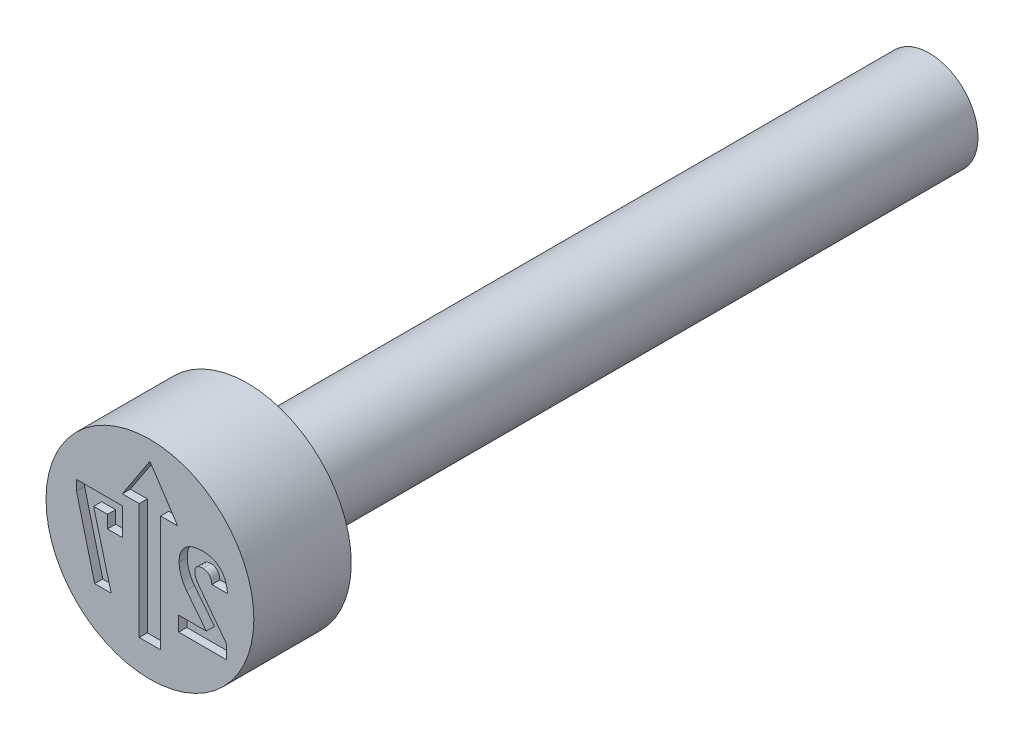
ISO-10303-21;
HEADER;
FILE_DESCRIPTION(('STEP AP214'),'2;1');
FILE_NAME('part.step','',(''),(''),'','','');
FILE_SCHEMA(('AUTOMOTIVE_DESIGN { 1 0 10303 214 1 1 1 1 }'));
ENDSEC;
DATA;
#1=APPLICATION_CONTEXT('core data for automotive mechanical design processes');
#2=APPLICATION_PROTOCOL_DEFINITION('international standard','automotive_design',2000,#1);
#3=PRODUCT_CONTEXT('',#1,'mechanical');
#4=PRODUCT('Part','Part','',(#3));
#5=PRODUCT_RELATED_PRODUCT_CATEGORY('part','',(#4));
#6=PRODUCT_DEFINITION_FORMATION('','',#4);
#7=PRODUCT_DEFINITION_CONTEXT('part definition',#1,'design');
#8=PRODUCT_DEFINITION('design','',#6,#7);
#9=PRODUCT_DEFINITION_SHAPE('','',#8);
#10=(LENGTH_UNIT() NAMED_UNIT(*) SI_UNIT(.MILLI.,.METRE.));
#11=(NAMED_UNIT(*) PLANE_ANGLE_UNIT() SI_UNIT($,.RADIAN.));
#12=(NAMED_UNIT(*) SI_UNIT($,.STERADIAN.) SOLID_ANGLE_UNIT());
#13=UNCERTAINTY_MEASURE_WITH_UNIT(LENGTH_MEASURE(1.E-05),#10,'distance_accuracy_value','');
#14=(GEOMETRIC_REPRESENTATION_CONTEXT(3) GLOBAL_UNCERTAINTY_ASSIGNED_CONTEXT((#13)) GLOBAL_UNIT_ASSIGNED_CONTEXT((#10,
#11,#12)) REPRESENTATION_CONTEXT('',''));
#15=CARTESIAN_POINT('',(0.,0.,0.));
#16=DIRECTION('',(0.,0.,1.));
#17=DIRECTION('',(1.,0.,0.));
#18=AXIS2_PLACEMENT_3D('',#15,#16,#17);
#19=CARTESIAN_POINT('',(-0.33,-2.25,-4.2002794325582));
#20=DIRECTION('',(-1.,0.,0.));
#21=DIRECTION('',(0.,0.,1.));
#22=AXIS2_PLACEMENT_3D('',#19,#20,#21);
#23=PLANE('',#22);
#24=DIRECTION('',(0.,-1.,0.));
#25=VECTOR('',#24,1.);
#26=CARTESIAN_POINT('',(-0.33,1.32083870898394,-0.24895886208));
#27=LINE('',#26,#25);
#28=CARTESIAN_POINT('',(-0.33,1.32083870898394,-0.24895886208));
#29=VERTEX_POINT('',#28);
#30=CARTESIAN_POINT('',(-0.33,-2.25,-0.24895886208));
#31=VERTEX_POINT('',#30);
#32=EDGE_CURVE('E51',#29,#31,#27,.T.);
#33=ORIENTED_EDGE('',*,*,#32,.F.);
#34=DIRECTION('',(0.,0.,1.));
#35=VECTOR('',#34,1.);
#36=CARTESIAN_POINT('',(-0.33,1.32083870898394,-0.28447943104));
#37=LINE('',#36,#35);
#38=CARTESIAN_POINT('',(-0.33,1.32083870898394,0.));
#39=VERTEX_POINT('',#38);
#40=EDGE_CURVE('E434',#39,#29,#37,.F.);
#41=ORIENTED_EDGE('',*,*,#40,.F.);
#42=DIRECTION('',(0.,1.,0.));
#43=VECTOR('',#42,1.);
#44=CARTESIAN_POINT('',(-0.33,0.,0.));
#45=LINE('',#44,#43);
#46=CARTESIAN_POINT('',(-0.33,-2.25,0.));
#47=VERTEX_POINT('',#46);
#48=EDGE_CURVE('E468',#47,#39,#45,.T.);
#49=ORIENTED_EDGE('',*,*,#48,.F.);
#50=DIRECTION('',(0.,0.,-1.));
#51=VECTOR('',#50,1.);
#52=CARTESIAN_POINT('',(-0.33,-2.25,-4.2002794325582));
#53=LINE('',#52,#51);
#54=EDGE_CURVE('E262',#47,#31,#53,.T.);
#55=ORIENTED_EDGE('',*,*,#54,.T.);
#56=EDGE_LOOP('',(#33,#41,#49,#55));
#57=FACE_BOUND('',#56,.T.);
#58=ADVANCED_FACE('F37',(#57),#23,.F.);
#59=CARTESIAN_POINT('',(5.684330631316E-13,1.32083870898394,-0.28447943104));
#60=DIRECTION('',(0.,1.,0.));
#61=DIRECTION('',(0.,0.,1.));
#62=AXIS2_PLACEMENT_3D('',#59,#60,#61);
#63=PLANE('',#62);
#64=ORIENTED_EDGE('',*,*,#40,.T.);
#65=DIRECTION('',(1.,0.,0.));
#66=VECTOR('',#65,1.);
#67=CARTESIAN_POINT('',(-0.851282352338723,1.32083870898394,-0.24895886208));
#68=LINE('',#67,#66);
#69=CARTESIAN_POINT('',(-0.851282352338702,1.32083870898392,-0.24895886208));
#70=VERTEX_POINT('',#69);
#71=EDGE_CURVE('E58',#70,#29,#68,.T.);
#72=ORIENTED_EDGE('',*,*,#71,.F.);
#73=DIRECTION('',(0.,0.,1.));
#74=VECTOR('',#73,1.);
#75=CARTESIAN_POINT('',(-0.851282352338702,1.32083870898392,-1.30047739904));
#76=LINE('',#75,#74);
#77=CARTESIAN_POINT('',(-0.851282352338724,1.32083870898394,0.));
#78=VERTEX_POINT('',#77);
#79=EDGE_CURVE('E438',#70,#78,#76,.T.);
#80=ORIENTED_EDGE('',*,*,#79,.T.);
#81=DIRECTION('',(1.,0.,0.));
#82=VECTOR('',#81,1.);
#83=CARTESIAN_POINT('',(1.59999680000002,1.32083870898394,0.));
#84=LINE('',#83,#82);
#85=EDGE_CURVE('E436',#39,#78,#84,.F.);
#86=ORIENTED_EDGE('',*,*,#85,.F.);
#87=EDGE_LOOP('',(#64,#72,#80,#86));
#88=FACE_BOUND('',#87,.T.);
#89=ADVANCED_FACE('F427',(#88),#63,.T.);
#90=CARTESIAN_POINT('',(-1.44383534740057,0.421431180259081,-1.30047739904));
#91=DIRECTION('',(-0.835059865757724,0.550159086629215,0.));
#92=DIRECTION('',(-0.550159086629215,-0.835059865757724,0.));
#93=AXIS2_PLACEMENT_3D('',#90,#91,#92);
#94=PLANE('',#93);
#95=DIRECTION('',(-0.550159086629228,-0.835059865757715,0.));
#96=VECTOR('',#95,1.);
#97=CARTESIAN_POINT('',(0.,2.61295901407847,-0.24895886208));
#98=LINE('',#97,#96);
#99=CARTESIAN_POINT('',(0.,2.61295901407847,-0.24895886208));
#100=VERTEX_POINT('',#99);
#101=EDGE_CURVE('E443',#100,#70,#98,.T.);
#102=ORIENTED_EDGE('',*,*,#101,.F.);
#103=DIRECTION('',(0.,0.,1.));
#104=VECTOR('',#103,1.);
#105=CARTESIAN_POINT('',(0.,2.61295901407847,-1.30047739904));
#106=LINE('',#105,#104);
#107=CARTESIAN_POINT('',(0.,2.61295901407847,0.));
#108=VERTEX_POINT('',#107);
#109=EDGE_CURVE('E456',#100,#108,#106,.T.);
#110=ORIENTED_EDGE('',*,*,#109,.T.);
#111=DIRECTION('',(0.550159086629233,0.835059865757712,0.));
#112=VECTOR('',#111,1.);
#113=CARTESIAN_POINT('',(-0.851282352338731,1.32083870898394,0.));
#114=LINE('',#113,#112);
#115=EDGE_CURVE('E463',#78,#108,#114,.T.);
#116=ORIENTED_EDGE('',*,*,#115,.F.);
#117=ORIENTED_EDGE('',*,*,#79,.F.);
#118=EDGE_LOOP('',(#102,#110,#116,#117));
#119=FACE_BOUND('',#118,.T.);
#120=ADVANCED_FACE('F424',(#119),#94,.F.);
#121=CARTESIAN_POINT('',(0.,2.61295901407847,-1.30047739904));
#122=DIRECTION('',(0.835059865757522,0.550159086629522,0.));
#123=DIRECTION('',(-0.550159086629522,0.835059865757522,0.));
#124=AXIS2_PLACEMENT_3D('',#121,#122,#123);
#125=PLANE('',#124);
#126=DIRECTION('',(-0.550159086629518,0.835059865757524,0.));
#127=VECTOR('',#126,1.);
#128=CARTESIAN_POINT('',(0.851282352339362,1.32083870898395,-0.24895886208));
#129=LINE('',#128,#127);
#130=CARTESIAN_POINT('',(0.851282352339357,1.32083870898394,-0.24895886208));
#131=VERTEX_POINT('',#130);
#132=EDGE_CURVE('E444',#131,#100,#129,.T.);
#133=ORIENTED_EDGE('',*,*,#132,.F.);
#134=DIRECTION('',(0.,0.,1.));
#135=VECTOR('',#134,1.);
#136=CARTESIAN_POINT('',(0.851282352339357,1.32083870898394,-0.28447943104));
#137=LINE('',#136,#135);
#138=CARTESIAN_POINT('',(0.851282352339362,1.32083870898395,0.));
#139=VERTEX_POINT('',#138);
#140=EDGE_CURVE('E451',#139,#131,#137,.F.);
#141=ORIENTED_EDGE('',*,*,#140,.F.);
#142=DIRECTION('',(0.550159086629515,-0.835059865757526,0.));
#143=VECTOR('',#142,1.);
#144=CARTESIAN_POINT('',(0.,2.61295901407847,0.));
#145=LINE('',#144,#143);
#146=EDGE_CURVE('E466',#108,#139,#145,.T.);
#147=ORIENTED_EDGE('',*,*,#146,.F.);
#148=ORIENTED_EDGE('',*,*,#109,.F.);
#149=EDGE_LOOP('',(#133,#141,#147,#148));
#150=FACE_BOUND('',#149,.T.);
#151=ADVANCED_FACE('F420',(#150),#125,.F.);
#152=CARTESIAN_POINT('',(5.684330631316E-13,1.32083870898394,-0.28447943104));
#153=DIRECTION('',(0.,1.,0.));
#154=DIRECTION('',(0.,0.,1.));
#155=AXIS2_PLACEMENT_3D('',#152,#153,#154);
#156=PLANE('',#155);
#157=ORIENTED_EDGE('',*,*,#140,.T.);
#158=DIRECTION('',(1.,0.,0.));
#159=VECTOR('',#158,1.);
#160=CARTESIAN_POINT('',(0.33,1.32083870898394,-0.24895886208));
#161=LINE('',#160,#159);
#162=CARTESIAN_POINT('',(0.33,1.32083870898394,-0.24895886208));
#163=VERTEX_POINT('',#162);
#164=EDGE_CURVE('E448',#163,#131,#161,.T.);
#165=ORIENTED_EDGE('',*,*,#164,.F.);
#166=DIRECTION('',(0.,0.,-1.));
#167=VECTOR('',#166,1.);
#168=CARTESIAN_POINT('',(0.33,1.32083870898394,-4.2002794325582));
#169=LINE('',#168,#167);
#170=CARTESIAN_POINT('',(0.33,1.32083870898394,0.));
#171=VERTEX_POINT('',#170);
#172=EDGE_CURVE('E263',#163,#171,#169,.F.);
#173=ORIENTED_EDGE('',*,*,#172,.T.);
#174=DIRECTION('',(1.,0.,0.));
#175=VECTOR('',#174,1.);
#176=CARTESIAN_POINT('',(1.59999680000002,1.32083870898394,0.));
#177=LINE('',#176,#175);
#178=EDGE_CURVE('E453',#139,#171,#177,.F.);
#179=ORIENTED_EDGE('',*,*,#178,.F.);
#180=EDGE_LOOP('',(#157,#165,#173,#179));
#181=FACE_BOUND('',#180,.T.);
#182=ADVANCED_FACE('F417',(#181),#156,.T.);
#183=CARTESIAN_POINT('',(0.33,-2.25,-4.2002794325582));
#184=DIRECTION('',(1.,0.,0.));
#185=DIRECTION('',(0.,0.,-1.));
#186=AXIS2_PLACEMENT_3D('',#183,#184,#185);
#187=PLANE('',#186);
#188=DIRECTION('',(0.,1.,0.));
#189=VECTOR('',#188,1.);
#190=CARTESIAN_POINT('',(0.33,-2.25,-0.24895886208));
#191=LINE('',#190,#189);
#192=CARTESIAN_POINT('',(0.33,-2.25,-0.24895886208));
#193=VERTEX_POINT('',#192);
#194=EDGE_CURVE('E267',#193,#163,#191,.T.);
#195=ORIENTED_EDGE('',*,*,#194,.F.);
#196=DIRECTION('',(0.,0.,-1.));
#197=VECTOR('',#196,1.);
#198=CARTESIAN_POINT('',(0.33,-2.25,-4.2002794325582));
#199=LINE('',#198,#197);
#200=CARTESIAN_POINT('',(0.33,-2.25,0.));
#201=VERTEX_POINT('',#200);
#202=EDGE_CURVE('E251',#193,#201,#199,.F.);
#203=ORIENTED_EDGE('',*,*,#202,.T.);
#204=DIRECTION('',(0.,1.,0.));
#205=VECTOR('',#204,1.);
#206=CARTESIAN_POINT('',(0.33,0.,0.));
#207=LINE('',#206,#205);
#208=EDGE_CURVE('E473',#171,#201,#207,.F.);
#209=ORIENTED_EDGE('',*,*,#208,.F.);
#210=ORIENTED_EDGE('',*,*,#172,.F.);
#211=EDGE_LOOP('',(#195,#203,#209,#210));
#212=FACE_BOUND('',#211,.T.);
#213=ADVANCED_FACE('F268',(#212),#187,.F.);
#214=CARTESIAN_POINT('',(-0.33,-2.25,-4.2002794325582));
#215=DIRECTION('',(0.,-1.,0.));
#216=DIRECTION('',(0.,0.,-1.));
#217=AXIS2_PLACEMENT_3D('',#214,#215,#216);
#218=PLANE('',#217);
#219=DIRECTION('',(1.,0.,0.));
#220=VECTOR('',#219,1.);
#221=CARTESIAN_POINT('',(-0.33,-2.25,-0.24895886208));
#222=LINE('',#221,#220);
#223=EDGE_CURVE('E256',#31,#193,#222,.T.);
#224=ORIENTED_EDGE('',*,*,#223,.F.);
#225=ORIENTED_EDGE('',*,*,#54,.F.);
#226=DIRECTION('',(1.,0.,0.));
#227=VECTOR('',#226,1.);
#228=CARTESIAN_POINT('',(1.59999680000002,-2.25,0.));
#229=LINE('',#228,#227);
#230=EDGE_CURVE('E258',#201,#47,#229,.F.);
#231=ORIENTED_EDGE('',*,*,#230,.F.);
#232=ORIENTED_EDGE('',*,*,#202,.F.);
#233=EDGE_LOOP('',(#224,#225,#231,#232));
#234=FACE_BOUND('',#233,.T.);
#235=ADVANCED_FACE('F253',(#234),#218,.F.);
#236=CARTESIAN_POINT('',(1.59999680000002,0.,0.));
#237=DIRECTION('',(0.,0.,1.));
#238=DIRECTION('',(1.,0.,0.));
#239=AXIS2_PLACEMENT_3D('',#236,#237,#238);
#240=PLANE('',#239);
#241=DIRECTION('',(-1.,0.,0.));
#242=VECTOR('',#241,1.);
#243=CARTESIAN_POINT('',(-0.83687877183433,1.,0.));
#244=LINE('',#243,#242);
#245=CARTESIAN_POINT('',(-0.83687877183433,1.,0.));
#246=VERTEX_POINT('',#245);
#247=CARTESIAN_POINT('',(-2.2593625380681,1.,0.));
#248=VERTEX_POINT('',#247);
#249=EDGE_CURVE('E271',#246,#248,#244,.T.);
#250=ORIENTED_EDGE('',*,*,#249,.F.);
#251=DIRECTION('',(0.,1.,0.));
#252=VECTOR('',#251,1.);
#253=CARTESIAN_POINT('',(-0.83687877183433,0.155844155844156,0.));
#254=LINE('',#253,#252);
#255=CARTESIAN_POINT('',(-0.83687877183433,0.155844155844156,0.));
#256=VERTEX_POINT('',#255);
#257=EDGE_CURVE('E282',#256,#246,#254,.T.);
#258=ORIENTED_EDGE('',*,*,#257,.F.);
#259=DIRECTION('',(1.,0.,0.));
#260=VECTOR('',#259,1.);
#261=CARTESIAN_POINT('',(-1.30613607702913,0.155844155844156,0.));
#262=LINE('',#261,#260);
#263=CARTESIAN_POINT('',(-1.30613607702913,0.155844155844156,0.));
#264=VERTEX_POINT('',#263);
#265=EDGE_CURVE('E326',#264,#256,#262,.T.);
#266=ORIENTED_EDGE('',*,*,#265,.F.);
#267=DIRECTION('',(0.,-1.,0.));
#268=VECTOR('',#267,1.);
#269=CARTESIAN_POINT('',(-1.30613607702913,0.545454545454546,0.));
#270=LINE('',#269,#268);
#271=CARTESIAN_POINT('',(-1.30613607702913,0.545454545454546,0.));
#272=VERTEX_POINT('',#271);
#273=EDGE_CURVE('E323',#272,#264,#270,.T.);
#274=ORIENTED_EDGE('',*,*,#273,.F.);
#275=DIRECTION('',(1.,0.,0.));
#276=VECTOR('',#275,1.);
#277=CARTESIAN_POINT('',(-1.73379435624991,0.545454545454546,0.));
#278=LINE('',#277,#276);
#279=CARTESIAN_POINT('',(-1.73379435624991,0.545454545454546,0.));
#280=VERTEX_POINT('',#279);
#281=EDGE_CURVE('E320',#280,#272,#278,.T.);
#282=ORIENTED_EDGE('',*,*,#281,.F.);
#283=DIRECTION('',(-0.255602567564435,0.966781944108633,0.));
#284=VECTOR('',#283,1.);
#285=CARTESIAN_POINT('',(-1.19300701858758,-1.5,0.));
#286=LINE('',#285,#284);
#287=CARTESIAN_POINT('',(-1.19300701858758,-1.5,0.));
#288=VERTEX_POINT('',#287);
#289=EDGE_CURVE('E317',#288,#280,#286,.T.);
#290=ORIENTED_EDGE('',*,*,#289,.F.);
#291=DIRECTION('',(1.,0.,0.));
#292=VECTOR('',#291,1.);
#293=CARTESIAN_POINT('',(-1.70132682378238,-1.5,0.));
#294=LINE('',#293,#292);
#295=CARTESIAN_POINT('',(-1.70132682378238,-1.5,0.));
#296=VERTEX_POINT('',#295);
#297=EDGE_CURVE('E314',#296,#288,#294,.T.);
#298=ORIENTED_EDGE('',*,*,#297,.F.);
#299=DIRECTION('',(0.247293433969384,-0.968940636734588,0.));
#300=VECTOR('',#299,1.);
#301=CARTESIAN_POINT('',(-2.2593625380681,0.68648538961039,0.));
#302=LINE('',#301,#300);
#303=CARTESIAN_POINT('',(-2.2593625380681,0.68648538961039,0.));
#304=VERTEX_POINT('',#303);
#305=EDGE_CURVE('E311',#304,#296,#302,.T.);
#306=ORIENTED_EDGE('',*,*,#305,.F.);
#307=DIRECTION('',(0.,-1.,0.));
#308=VECTOR('',#307,1.);
#309=CARTESIAN_POINT('',(-2.2593625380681,1.,0.));
#310=LINE('',#309,#308);
#311=EDGE_CURVE('E308',#248,#304,#310,.T.);
#312=ORIENTED_EDGE('',*,*,#311,.F.);
#313=EDGE_LOOP('',(#250,#258,#266,#274,#282,#290,#298,#306,#312));
#314=FACE_BOUND('',#313,.T.);
#315=DIRECTION('',(1.,0.,0.));
#316=VECTOR('',#315,1.);
#317=CARTESIAN_POINT('',(0.885949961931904,-1.5,0.));
#318=LINE('',#317,#316);
#319=CARTESIAN_POINT('',(0.885949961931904,-1.5,0.));
#320=VERTEX_POINT('',#319);
#321=CARTESIAN_POINT('',(2.35814963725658,-1.5,0.));
#322=VERTEX_POINT('',#321);
#323=EDGE_CURVE('E333',#320,#322,#318,.T.);
#324=ORIENTED_EDGE('',*,*,#323,.F.);
#325=DIRECTION('',(0.,-1.,0.));
#326=VECTOR('',#325,1.);
#327=CARTESIAN_POINT('',(0.885949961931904,-1.04545454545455,0.));
#328=LINE('',#327,#326);
#329=CARTESIAN_POINT('',(0.885949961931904,-1.04545454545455,0.));
#330=VERTEX_POINT('',#329);
#331=EDGE_CURVE('E354',#330,#320,#328,.T.);
#332=ORIENTED_EDGE('',*,*,#331,.F.);
#333=DIRECTION('',(-1.,0.,0.));
#334=VECTOR('',#333,1.);
#335=CARTESIAN_POINT('',(1.73670077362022,-1.04545454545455,0.));
#336=LINE('',#335,#334);
#337=CARTESIAN_POINT('',(1.73670077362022,-1.04545454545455,0.));
#338=VERTEX_POINT('',#337);
#339=EDGE_CURVE('E522',#338,#330,#336,.T.);
#340=ORIENTED_EDGE('',*,*,#339,.F.);
#341=DIRECTION('',(0.618183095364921,-0.786034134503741,0.));
#342=VECTOR('',#341,1.);
#343=CARTESIAN_POINT('',(1.12387609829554,-0.266233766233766,0.));
#344=LINE('',#343,#342);
#345=CARTESIAN_POINT('',(1.12387609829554,-0.266233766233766,0.));
#346=VERTEX_POINT('',#345);
#347=EDGE_CURVE('E525',#346,#338,#344,.T.);
#348=ORIENTED_EDGE('',*,*,#347,.F.);
#349=CARTESIAN_POINT('',(0.899647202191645,0.377029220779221,0.));
#350=CARTESIAN_POINT('',(0.900293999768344,0.3485838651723,0.));
#351=CARTESIAN_POINT('',(0.901588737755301,0.29164289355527,0.));
#352=CARTESIAN_POINT('',(0.913275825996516,0.206422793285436,0.));
#353=CARTESIAN_POINT('',(0.932109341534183,0.121637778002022,0.));
#354=CARTESIAN_POINT('',(0.957974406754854,0.0376974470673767,0.));
#355=CARTESIAN_POINT('',(0.990105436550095,-0.0439442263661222,0.));
#356=CARTESIAN_POINT('',(1.02866885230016,-0.122169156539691,0.));
#357=CARTESIAN_POINT('',(1.0721926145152,-0.197011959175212,0.));
#358=CARTESIAN_POINT('',(1.10668125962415,-0.243204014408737,0.));
#359=CARTESIAN_POINT('',(1.12387609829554,-0.266233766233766,0.));
#360=B_SPLINE_CURVE_WITH_KNOTS('',3,(#349,#350,#351,#352,#353,#354,#355,#356,#357,#358,#359),
.UNSPECIFIED.,.F.,.F.,(4,1,1,1,1,1,1,1,4),(0.,0.123046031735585,0.246309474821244,
0.371480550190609,0.498560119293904,0.626024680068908,0.750715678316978,0.875715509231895,1.),.UNSPECIFIED.);
#361=CARTESIAN_POINT('',(0.899647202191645,0.377029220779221,0.));
#362=VERTEX_POINT('',#361);
#363=EDGE_CURVE('E528',#362,#346,#360,.T.);
#364=ORIENTED_EDGE('',*,*,#363,.F.);
#365=DIRECTION('',(0.,-1.,0.));
#366=VECTOR('',#365,1.);
#367=CARTESIAN_POINT('',(0.899647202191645,0.379058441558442,0.));
#368=LINE('',#367,#366);
#369=CARTESIAN_POINT('',(0.899647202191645,0.379058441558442,0.));
#370=VERTEX_POINT('',#369);
#371=EDGE_CURVE('E533',#370,#362,#368,.T.);
#372=ORIENTED_EDGE('',*,*,#371,.F.);
#373=CARTESIAN_POINT('',(1.63574703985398,1.03246753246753,0.));
#374=CARTESIAN_POINT('',(1.60731502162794,1.0320636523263,0.));
#375=CARTESIAN_POINT('',(1.55201850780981,1.03127815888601,0.));
#376=CARTESIAN_POINT('',(1.47151635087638,1.02279900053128,0.));
#377=CARTESIAN_POINT('',(1.39577235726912,1.01000147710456,0.));
#378=CARTESIAN_POINT('',(1.32490841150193,0.991279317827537,0.));
#379=CARTESIAN_POINT('',(1.25920900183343,0.966857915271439,0.));
#380=CARTESIAN_POINT('',(1.19847731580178,0.937411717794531,0.));
#381=CARTESIAN_POINT('',(1.14258640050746,0.902689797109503,0.));
#382=CARTESIAN_POINT('',(1.09196429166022,0.862617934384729,0.));
#383=CARTESIAN_POINT('',(1.04641690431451,0.817924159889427,0.));
#384=CARTESIAN_POINT('',(1.00721289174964,0.768154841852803,0.));
#385=CARTESIAN_POINT('',(0.973275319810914,0.714316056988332,0.));
#386=CARTESIAN_POINT('',(0.946746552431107,0.655363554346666,0.));
#387=CARTESIAN_POINT('',(0.924905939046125,0.592683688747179,0.));
#388=CARTESIAN_POINT('',(0.910764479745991,0.525152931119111,0.));
#389=CARTESIAN_POINT('',(0.90123493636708,0.453566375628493,0.));
#390=CARTESIAN_POINT('',(0.900184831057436,0.404287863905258,0.));
#391=CARTESIAN_POINT('',(0.899647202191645,0.379058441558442,0.));
#392=B_SPLINE_CURVE_WITH_KNOTS('',3,(#373,#374,#375,#376,#377,#378,#379,#380,#381,#382,#383,
#384,#385,#386,#387,#388,#389,#390,#391),.UNSPECIFIED.,.F.,.F.,(4,1,1,1,1,1,1,1,1,1,1,1,1,1,1,1,
4),(0.,0.0762312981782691,0.148259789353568,0.216860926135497,0.28210063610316,
0.344528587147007,0.404571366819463,0.462840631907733,0.520642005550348,0.577409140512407,
0.633580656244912,0.690215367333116,0.747647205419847,0.806597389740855,0.867894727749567,
0.932365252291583,1.),.UNSPECIFIED.);
#393=CARTESIAN_POINT('',(1.63574703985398,1.03246753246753,0.));
#394=VERTEX_POINT('',#393);
#395=EDGE_CURVE('E539',#394,#370,#392,.T.);
#396=ORIENTED_EDGE('',*,*,#395,.F.);
#397=CARTESIAN_POINT('',(2.3890952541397,0.282163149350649,0.));
#398=CARTESIAN_POINT('',(2.38672218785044,0.311141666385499,0.));
#399=CARTESIAN_POINT('',(2.38209001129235,0.367707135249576,0.));
#400=CARTESIAN_POINT('',(2.36690372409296,0.449531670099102,0.));
#401=CARTESIAN_POINT('',(2.34727604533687,0.526604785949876,0.));
#402=CARTESIAN_POINT('',(2.32230699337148,0.598911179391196,0.));
#403=CARTESIAN_POINT('',(2.29022167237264,0.665613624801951,0.));
#404=CARTESIAN_POINT('',(2.25417283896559,0.7281065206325,0.));
#405=CARTESIAN_POINT('',(2.21081512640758,0.784456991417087,0.));
#406=CARTESIAN_POINT('',(2.16335403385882,0.836550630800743,0.));
#407=CARTESIAN_POINT('',(2.11049086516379,0.88243395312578,0.));
#408=CARTESIAN_POINT('',(2.05412420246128,0.922909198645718,0.));
#409=CARTESIAN_POINT('',(1.99340169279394,0.956591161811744,0.));
#410=CARTESIAN_POINT('',(1.92924648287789,0.984532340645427,0.));
#411=CARTESIAN_POINT('',(1.86094727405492,1.00573890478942,0.));
#412=CARTESIAN_POINT('',(1.78939621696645,1.02162423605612,0.));
#413=CARTESIAN_POINT('',(1.71377203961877,1.0307853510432,0.));
#414=CARTESIAN_POINT('',(1.66215141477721,1.03189826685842,0.));
#415=CARTESIAN_POINT('',(1.63574703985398,1.03246753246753,0.));
#416=B_SPLINE_CURVE_WITH_KNOTS('',3,(#397,#398,#399,#400,#401,#402,#403,#404,#405,#406,#407,
#408,#409,#410,#411,#412,#413,#414,#415),.UNSPECIFIED.,.F.,.F.,(4,1,1,1,1,1,1,1,1,1,1,1,1,1,1,1,
4),(0.,0.073326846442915,0.14313249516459,0.209679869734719,0.273918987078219,0.33576228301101,
0.396210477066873,0.45560885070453,0.514796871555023,0.573764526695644,0.631900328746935,
0.689592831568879,0.748648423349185,0.808163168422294,0.86976604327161,0.933384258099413,1.),.UNSPECIFIED.);
#417=CARTESIAN_POINT('',(2.3890952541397,0.282163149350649,0.));
#418=VERTEX_POINT('',#417);
#419=EDGE_CURVE('E544',#418,#394,#416,.T.);
#420=ORIENTED_EDGE('',*,*,#419,.F.);
#421=DIRECTION('',(0.,1.,0.));
#422=VECTOR('',#421,1.);
#423=CARTESIAN_POINT('',(2.3890952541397,0.280641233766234,0.));
#424=LINE('',#423,#422);
#425=CARTESIAN_POINT('',(2.3890952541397,0.280641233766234,0.));
#426=VERTEX_POINT('',#425);
#427=EDGE_CURVE('E552',#426,#418,#424,.T.);
#428=ORIENTED_EDGE('',*,*,#427,.F.);
#429=DIRECTION('',(1.,0.,0.));
#430=VECTOR('',#429,1.);
#431=CARTESIAN_POINT('',(1.90816992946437,0.280641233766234,0.));
#432=LINE('',#431,#430);
#433=CARTESIAN_POINT('',(1.90816992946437,0.280641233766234,0.));
#434=VERTEX_POINT('',#433);
#435=EDGE_CURVE('E558',#434,#426,#432,.T.);
#436=ORIENTED_EDGE('',*,*,#435,.F.);
#437=DIRECTION('',(0.,-1.,0.));
#438=VECTOR('',#437,1.);
#439=CARTESIAN_POINT('',(1.90816992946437,0.282163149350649,0.));
#440=LINE('',#439,#438);
#441=CARTESIAN_POINT('',(1.90816992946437,0.282163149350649,0.));
#442=VERTEX_POINT('',#441);
#443=EDGE_CURVE('E561',#442,#434,#440,.T.);
#444=ORIENTED_EDGE('',*,*,#443,.F.);
#445=CARTESIAN_POINT('',(1.63219590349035,0.577922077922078,0.));
#446=CARTESIAN_POINT('',(1.65057456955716,0.577204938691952,0.));
#447=CARTESIAN_POINT('',(1.68628495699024,0.57581151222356,0.));
#448=CARTESIAN_POINT('',(1.73683909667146,0.56036841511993,0.));
#449=CARTESIAN_POINT('',(1.78239330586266,0.536144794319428,0.));
#450=CARTESIAN_POINT('',(1.82166465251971,0.501580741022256,0.));
#451=CARTESIAN_POINT('',(1.85418430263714,0.458184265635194,0.));
#452=CARTESIAN_POINT('',(1.88057714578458,0.407081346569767,0.));
#453=CARTESIAN_POINT('',(1.89850296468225,0.347349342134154,0.));
#454=CARTESIAN_POINT('',(1.90484392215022,0.304591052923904,0.));
#455=CARTESIAN_POINT('',(1.90816992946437,0.282163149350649,0.));
#456=B_SPLINE_CURVE_WITH_KNOTS('',3,(#445,#446,#447,#448,#449,#450,#451,#452,#453,#454,#455),
.UNSPECIFIED.,.F.,.F.,(4,1,1,1,1,1,1,1,4),(0.,0.122603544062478,0.238222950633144,
0.350089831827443,0.465559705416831,0.58502806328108,0.711014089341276,0.848418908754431,1.),.UNSPECIFIED.);
#457=CARTESIAN_POINT('',(1.63219590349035,0.577922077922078,0.));
#458=VERTEX_POINT('',#457);
#459=EDGE_CURVE('E564',#458,#442,#456,.T.);
#460=ORIENTED_EDGE('',*,*,#459,.F.);
#461=CARTESIAN_POINT('',(1.38260174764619,0.365868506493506,0.));
#462=CARTESIAN_POINT('',(1.38329475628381,0.381853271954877,0.));
#463=CARTESIAN_POINT('',(1.38462245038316,0.41247753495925,0.));
#464=CARTESIAN_POINT('',(1.39713141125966,0.455627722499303,0.));
#465=CARTESIAN_POINT('',(1.41763292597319,0.493204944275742,0.));
#466=CARTESIAN_POINT('',(1.44699604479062,0.524243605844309,0.));
#467=CARTESIAN_POINT('',(1.48355088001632,0.54879331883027,0.));
#468=CARTESIAN_POINT('',(1.52728975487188,0.566094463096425,0.));
#469=CARTESIAN_POINT('',(1.57764038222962,0.576015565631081,0.));
#470=CARTESIAN_POINT('',(1.61337907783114,0.577264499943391,0.));
#471=CARTESIAN_POINT('',(1.63219590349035,0.577922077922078,0.));
#472=B_SPLINE_CURVE_WITH_KNOTS('',3,(#461,#462,#463,#464,#465,#466,#467,#468,#469,#470,#471),
.UNSPECIFIED.,.F.,.F.,(4,1,1,1,1,1,1,1,4),(0.,0.128749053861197,0.246662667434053,
0.359069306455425,0.47107757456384,0.588039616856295,0.711712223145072,0.848213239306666,1.),.UNSPECIFIED.);
#473=CARTESIAN_POINT('',(1.38260174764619,0.365868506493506,0.));
#474=VERTEX_POINT('',#473);
#475=EDGE_CURVE('E569',#474,#458,#472,.T.);
#476=ORIENTED_EDGE('',*,*,#475,.F.);
#477=DIRECTION('',(0.,1.,0.));
#478=VECTOR('',#477,1.);
#479=CARTESIAN_POINT('',(1.38260174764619,0.36231737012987,0.));
#480=LINE('',#479,#478);
#481=CARTESIAN_POINT('',(1.38260174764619,0.36231737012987,0.));
#482=VERTEX_POINT('',#481);
#483=EDGE_CURVE('E577',#482,#474,#480,.T.);
#484=ORIENTED_EDGE('',*,*,#483,.F.);
#485=CARTESIAN_POINT('',(1.50384768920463,0.0569196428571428,0.));
#486=CARTESIAN_POINT('',(1.48595418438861,0.0821325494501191,0.));
#487=CARTESIAN_POINT('',(1.45108923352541,0.131259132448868,0.));
#488=CARTESIAN_POINT('',(1.41953376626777,0.198724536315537,0.));
#489=CARTESIAN_POINT('',(1.39987601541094,0.251618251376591,0.));
#490=CARTESIAN_POINT('',(1.39050756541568,0.289976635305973,0.));
#491=CARTESIAN_POINT('',(1.38382440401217,0.326574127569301,0.));
#492=CARTESIAN_POINT('',(1.383001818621,0.350621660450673,0.));
#493=CARTESIAN_POINT('',(1.38260174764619,0.36231737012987,0.));
#494=B_SPLINE_CURVE_WITH_KNOTS('',3,(#485,#486,#487,#488,#489,#490,#491,#492,#493),
.UNSPECIFIED.,.F.,.F.,(4,1,1,1,1,1,4),(0.,0.277375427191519,0.540457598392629,0.666416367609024,
0.784009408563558,0.894951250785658,1.),.UNSPECIFIED.);
#495=CARTESIAN_POINT('',(1.50384768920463,0.0569196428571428,0.));
#496=VERTEX_POINT('',#495);
#497=EDGE_CURVE('E583',#496,#482,#494,.T.);
#498=ORIENTED_EDGE('',*,*,#497,.F.);
#499=DIRECTION('',(-0.602458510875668,0.798150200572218,0.));
#500=VECTOR('',#499,1.);
#501=CARTESIAN_POINT('',(2.35814963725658,-1.07487824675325,0.));
#502=LINE('',#501,#500);
#503=CARTESIAN_POINT('',(2.35814963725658,-1.07487824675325,0.));
#504=VERTEX_POINT('',#503);
#505=EDGE_CURVE('E588',#504,#496,#502,.T.);
#506=ORIENTED_EDGE('',*,*,#505,.F.);
#507=DIRECTION('',(0.,1.,0.));
#508=VECTOR('',#507,1.);
#509=CARTESIAN_POINT('',(2.35814963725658,-1.5,0.));
#510=LINE('',#509,#508);
#511=EDGE_CURVE('E594',#322,#504,#510,.T.);
#512=ORIENTED_EDGE('',*,*,#511,.F.);
#513=EDGE_LOOP('',(#324,#332,#340,#348,#364,#372,#396,#420,#428,#436,#444,#460,#476,#484,#498,
#506,#512));
#514=FACE_BOUND('',#513,.T.);
#515=CARTESIAN_POINT('',(0.,0.,0.));
#516=DIRECTION('',(0.,0.,-1.));
#517=DIRECTION('',(-1.,0.,0.));
#518=AXIS2_PLACEMENT_3D('',#515,#516,#517);
#519=CIRCLE('',#518,3.1999936);
#520=CARTESIAN_POINT('',(-3.1999936,0.,0.));
#521=VERTEX_POINT('',#520);
#522=EDGE_CURVE('E40',#521,#521,#519,.T.);
#523=ORIENTED_EDGE('',*,*,#522,.F.);
#524=EDGE_LOOP('',(#523));
#525=FACE_BOUND('',#524,.T.);
#526=ORIENTED_EDGE('',*,*,#208,.T.);
#527=ORIENTED_EDGE('',*,*,#230,.T.);
#528=ORIENTED_EDGE('',*,*,#48,.T.);
#529=ORIENTED_EDGE('',*,*,#85,.T.);
#530=ORIENTED_EDGE('',*,*,#115,.T.);
#531=ORIENTED_EDGE('',*,*,#146,.T.);
#532=ORIENTED_EDGE('',*,*,#178,.T.);
#533=EDGE_LOOP('',(#526,#527,#528,#529,#530,#531,#532));
#534=FACE_BOUND('',#533,.T.);
#535=ADVANCED_FACE('F399',(#314,#514,#525,#534),#240,.T.);
#536=CARTESIAN_POINT('',(0.,0.,-1.499997));
#537=DIRECTION('',(0.,0.,-1.));
#538=DIRECTION('',(-1.,0.,0.));
#539=AXIS2_PLACEMENT_3D('',#536,#537,#538);
#540=CYLINDRICAL_SURFACE('',#539,3.1999936);
#541=ORIENTED_EDGE('',*,*,#522,.T.);
#542=EDGE_LOOP('',(#541));
#543=FACE_BOUND('',#542,.T.);
#544=CARTESIAN_POINT('',(0.,0.,-2.999994));
#545=DIRECTION('',(0.,0.,-1.));
#546=DIRECTION('',(-1.,0.,0.));
#547=AXIS2_PLACEMENT_3D('',#544,#545,#546);
#548=CIRCLE('',#547,3.1999936);
#549=CARTESIAN_POINT('',(-3.1999936,0.,-2.999994));
#550=VERTEX_POINT('',#549);
#551=EDGE_CURVE('E11',#550,#550,#548,.T.);
#552=ORIENTED_EDGE('',*,*,#551,.F.);
#553=EDGE_LOOP('',(#552));
#554=FACE_BOUND('',#553,.T.);
#555=ADVANCED_FACE('F405',(#543,#554),#540,.T.);
#556=CARTESIAN_POINT('',(2.47499505,0.,-2.999994));
#557=DIRECTION('',(0.,0.,-1.));
#558=DIRECTION('',(-1.,0.,0.));
#559=AXIS2_PLACEMENT_3D('',#556,#557,#558);
#560=PLANE('',#559);
#561=ORIENTED_EDGE('',*,*,#551,.T.);
#562=EDGE_LOOP('',(#561));
#563=FACE_BOUND('',#562,.T.);
#564=CARTESIAN_POINT('',(-1.56512724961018E-13,0.,-2.99999400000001));
#565=DIRECTION('',(0.,0.,1.));
#566=DIRECTION('',(1.,0.,0.));
#567=AXIS2_PLACEMENT_3D('',#564,#565,#566);
#568=CIRCLE('',#567,1.50000000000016);
#569=CARTESIAN_POINT('',(1.5,0.,-2.999994));
#570=VERTEX_POINT('',#569);
#571=EDGE_CURVE('E439',#570,#570,#568,.T.);
#572=ORIENTED_EDGE('',*,*,#571,.T.);
#573=EDGE_LOOP('',(#572));
#574=FACE_BOUND('',#573,.T.);
#575=ADVANCED_FACE('F397',(#563,#574),#560,.T.);
#576=CARTESIAN_POINT('',(0.,0.,-23.999952));
#577=DIRECTION('',(0.,0.,1.));
#578=DIRECTION('',(1.,0.,0.));
#579=AXIS2_PLACEMENT_3D('',#576,#577,#578);
#580=CYLINDRICAL_SURFACE('',#579,1.50000000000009);
#581=ORIENTED_EDGE('',*,*,#571,.F.);
#582=EDGE_LOOP('',(#581));
#583=FACE_BOUND('',#582,.T.);
#584=CARTESIAN_POINT('',(0.,0.,-23.999952));
#585=DIRECTION('',(0.,0.,1.));
#586=DIRECTION('',(1.,0.,0.));
#587=AXIS2_PLACEMENT_3D('',#584,#585,#586);
#588=CIRCLE('',#587,1.50000000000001);
#589=CARTESIAN_POINT('',(1.5,0.,-23.999952));
#590=VERTEX_POINT('',#589);
#591=EDGE_CURVE('E481',#590,#590,#588,.T.);
#592=ORIENTED_EDGE('',*,*,#591,.T.);
#593=EDGE_LOOP('',(#592));
#594=FACE_BOUND('',#593,.T.);
#595=ADVANCED_FACE('F394',(#583,#594),#580,.T.);
#596=CARTESIAN_POINT('',(0.874998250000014,0.,-23.999952));
#597=DIRECTION('',(0.,0.,-1.));
#598=DIRECTION('',(-1.,0.,0.));
#599=AXIS2_PLACEMENT_3D('',#596,#597,#598);
#600=PLANE('',#599);
#601=ORIENTED_EDGE('',*,*,#591,.F.);
#602=EDGE_LOOP('',(#601));
#603=FACE_BOUND('',#602,.T.);
#604=ADVANCED_FACE('F392',(#603),#600,.T.);
#605=CARTESIAN_POINT('',(0.885949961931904,-1.5,-0.25));
#606=DIRECTION('',(0.,-1.,0.));
#607=DIRECTION('',(0.,0.,-1.));
#608=AXIS2_PLACEMENT_3D('',#605,#606,#607);
#609=PLANE('',#608);
#610=ORIENTED_EDGE('',*,*,#323,.T.);
#611=DIRECTION('',(0.,0.,1.));
#612=VECTOR('',#611,1.);
#613=CARTESIAN_POINT('',(2.35814963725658,-1.5,-0.25));
#614=LINE('',#613,#612);
#615=CARTESIAN_POINT('',(2.35814963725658,-1.5,-0.25));
#616=VERTEX_POINT('',#615);
#617=EDGE_CURVE('E485',#616,#322,#614,.T.);
#618=ORIENTED_EDGE('',*,*,#617,.F.);
#619=DIRECTION('',(1.,0.,0.));
#620=VECTOR('',#619,1.);
#621=CARTESIAN_POINT('',(0.885949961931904,-1.5,-0.25));
#622=LINE('',#621,#620);
#623=CARTESIAN_POINT('',(0.885949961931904,-1.5,-0.25));
#624=VERTEX_POINT('',#623);
#625=EDGE_CURVE('E350',#624,#616,#622,.T.);
#626=ORIENTED_EDGE('',*,*,#625,.F.);
#627=DIRECTION('',(0.,0.,1.));
#628=VECTOR('',#627,1.);
#629=CARTESIAN_POINT('',(0.885949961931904,-1.5,-0.25));
#630=LINE('',#629,#628);
#631=EDGE_CURVE('E484',#624,#320,#630,.T.);
#632=ORIENTED_EDGE('',*,*,#631,.T.);
#633=EDGE_LOOP('',(#610,#618,#626,#632));
#634=FACE_BOUND('',#633,.T.);
#635=ADVANCED_FACE('F388',(#634),#609,.F.);
#636=CARTESIAN_POINT('',(0.885949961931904,-1.04545454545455,-0.25));
#637=DIRECTION('',(-1.,0.,0.));
#638=DIRECTION('',(0.,0.,1.));
#639=AXIS2_PLACEMENT_3D('',#636,#637,#638);
#640=PLANE('',#639);
#641=ORIENTED_EDGE('',*,*,#331,.T.);
#642=ORIENTED_EDGE('',*,*,#631,.F.);
#643=DIRECTION('',(0.,-1.,0.));
#644=VECTOR('',#643,1.);
#645=CARTESIAN_POINT('',(0.885949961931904,-1.04545454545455,-0.25));
#646=LINE('',#645,#644);
#647=CARTESIAN_POINT('',(0.885949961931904,-1.04545454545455,-0.25));
#648=VERTEX_POINT('',#647);
#649=EDGE_CURVE('E489',#648,#624,#646,.T.);
#650=ORIENTED_EDGE('',*,*,#649,.F.);
#651=DIRECTION('',(0.,0.,1.));
#652=VECTOR('',#651,1.);
#653=CARTESIAN_POINT('',(0.885949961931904,-1.04545454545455,-0.25));
#654=LINE('',#653,#652);
#655=EDGE_CURVE('E517',#648,#330,#654,.T.);
#656=ORIENTED_EDGE('',*,*,#655,.T.);
#657=EDGE_LOOP('',(#641,#642,#650,#656));
#658=FACE_BOUND('',#657,.T.);
#659=ADVANCED_FACE('F391',(#658),#640,.F.);
#660=CARTESIAN_POINT('',(1.73670077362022,-1.04545454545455,-0.25));
#661=DIRECTION('',(0.,1.,0.));
#662=DIRECTION('',(0.,0.,1.));
#663=AXIS2_PLACEMENT_3D('',#660,#661,#662);
#664=PLANE('',#663);
#665=ORIENTED_EDGE('',*,*,#339,.T.);
#666=ORIENTED_EDGE('',*,*,#655,.F.);
#667=DIRECTION('',(-1.,0.,0.));
#668=VECTOR('',#667,1.);
#669=CARTESIAN_POINT('',(1.73670077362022,-1.04545454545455,-0.25));
#670=LINE('',#669,#668);
#671=CARTESIAN_POINT('',(1.73670077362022,-1.04545454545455,-0.25));
#672=VERTEX_POINT('',#671);
#673=EDGE_CURVE('E600',#672,#648,#670,.T.);
#674=ORIENTED_EDGE('',*,*,#673,.F.);
#675=DIRECTION('',(0.,0.,1.));
#676=VECTOR('',#675,1.);
#677=CARTESIAN_POINT('',(1.73670077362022,-1.04545454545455,-0.25));
#678=LINE('',#677,#676);
#679=EDGE_CURVE('E515',#672,#338,#678,.T.);
#680=ORIENTED_EDGE('',*,*,#679,.T.);
#681=EDGE_LOOP('',(#665,#666,#674,#680));
#682=FACE_BOUND('',#681,.T.);
#683=ADVANCED_FACE('F716',(#682),#664,.F.);
#684=CARTESIAN_POINT('',(1.12387609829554,-0.266233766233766,-0.25));
#685=DIRECTION('',(-0.786034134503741,-0.618183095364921,0.));
#686=DIRECTION('',(0.618183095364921,-0.786034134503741,0.));
#687=AXIS2_PLACEMENT_3D('',#684,#685,#686);
#688=PLANE('',#687);
#689=ORIENTED_EDGE('',*,*,#347,.T.);
#690=ORIENTED_EDGE('',*,*,#679,.F.);
#691=DIRECTION('',(0.618183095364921,-0.786034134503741,0.));
#692=VECTOR('',#691,1.);
#693=CARTESIAN_POINT('',(1.12387609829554,-0.266233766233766,-0.25));
#694=LINE('',#693,#692);
#695=CARTESIAN_POINT('',(1.12387609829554,-0.266233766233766,-0.25));
#696=VERTEX_POINT('',#695);
#697=EDGE_CURVE('E603',#696,#672,#694,.T.);
#698=ORIENTED_EDGE('',*,*,#697,.F.);
#699=DIRECTION('',(0.,0.,1.));
#700=VECTOR('',#699,1.);
#701=CARTESIAN_POINT('',(1.12387609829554,-0.266233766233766,-0.25));
#702=LINE('',#701,#700);
#703=EDGE_CURVE('E513',#696,#346,#702,.T.);
#704=ORIENTED_EDGE('',*,*,#703,.T.);
#705=EDGE_LOOP('',(#689,#690,#698,#704));
#706=FACE_BOUND('',#705,.T.);
#707=ADVANCED_FACE('F623',(#706),#688,.F.);
#708=CARTESIAN_POINT('',(0.899647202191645,0.377029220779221,-0.25));
#709=CARTESIAN_POINT('',(0.900293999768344,0.3485838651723,-0.25));
#710=CARTESIAN_POINT('',(0.901588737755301,0.29164289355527,-0.25));
#711=CARTESIAN_POINT('',(0.913275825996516,0.206422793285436,-0.25));
#712=CARTESIAN_POINT('',(0.932109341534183,0.121637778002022,-0.25));
#713=CARTESIAN_POINT('',(0.957974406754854,0.0376974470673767,-0.25));
#714=CARTESIAN_POINT('',(0.990105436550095,-0.0439442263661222,-0.25));
#715=CARTESIAN_POINT('',(1.02866885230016,-0.122169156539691,-0.25));
#716=CARTESIAN_POINT('',(1.0721926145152,-0.197011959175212,-0.25));
#717=CARTESIAN_POINT('',(1.10668125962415,-0.243204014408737,-0.25));
#718=CARTESIAN_POINT('',(1.12387609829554,-0.266233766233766,-0.25));
#719=B_SPLINE_CURVE_WITH_KNOTS('',3,(#708,#709,#710,#711,#712,#713,#714,#715,#716,#717,#718),
.UNSPECIFIED.,.F.,.F.,(4,1,1,1,1,1,1,1,4),(0.,0.123046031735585,0.246309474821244,
0.371480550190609,0.498560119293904,0.626024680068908,0.750715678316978,0.875715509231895,1.),.UNSPECIFIED.);
#720=DIRECTION('',(0.,0.,1.));
#721=VECTOR('',#720,1.);
#722=SURFACE_OF_LINEAR_EXTRUSION('',#719,#721);
#723=ORIENTED_EDGE('',*,*,#363,.T.);
#724=ORIENTED_EDGE('',*,*,#703,.F.);
#725=CARTESIAN_POINT('',(0.899647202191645,0.377029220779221,-0.25));
#726=VERTEX_POINT('',#725);
#727=EDGE_CURVE('E606',#726,#696,#719,.T.);
#728=ORIENTED_EDGE('',*,*,#727,.F.);
#729=DIRECTION('',(0.,0.,1.));
#730=VECTOR('',#729,1.);
#731=CARTESIAN_POINT('',(0.899647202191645,0.377029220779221,-0.25));
#732=LINE('',#731,#730);
#733=EDGE_CURVE('E511',#726,#362,#732,.T.);
#734=ORIENTED_EDGE('',*,*,#733,.T.);
#735=EDGE_LOOP('',(#723,#724,#728,#734));
#736=FACE_BOUND('',#735,.T.);
#737=ADVANCED_FACE('F618',(#736),#722,.F.);
#738=CARTESIAN_POINT('',(0.899647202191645,0.379058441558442,-0.25));
#739=DIRECTION('',(-1.,0.,0.));
#740=DIRECTION('',(0.,0.,1.));
#741=AXIS2_PLACEMENT_3D('',#738,#739,#740);
#742=PLANE('',#741);
#743=ORIENTED_EDGE('',*,*,#371,.T.);
#744=ORIENTED_EDGE('',*,*,#733,.F.);
#745=DIRECTION('',(0.,-1.,0.));
#746=VECTOR('',#745,1.);
#747=CARTESIAN_POINT('',(0.899647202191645,0.379058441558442,-0.25));
#748=LINE('',#747,#746);
#749=CARTESIAN_POINT('',(0.899647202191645,0.379058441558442,-0.25));
#750=VERTEX_POINT('',#749);
#751=EDGE_CURVE('E612',#750,#726,#748,.T.);
#752=ORIENTED_EDGE('',*,*,#751,.F.);
#753=DIRECTION('',(0.,0.,1.));
#754=VECTOR('',#753,1.);
#755=CARTESIAN_POINT('',(0.899647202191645,0.379058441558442,-0.25));
#756=LINE('',#755,#754);
#757=EDGE_CURVE('E509',#750,#370,#756,.T.);
#758=ORIENTED_EDGE('',*,*,#757,.T.);
#759=EDGE_LOOP('',(#743,#744,#752,#758));
#760=FACE_BOUND('',#759,.T.);
#761=ADVANCED_FACE('F622',(#760),#742,.F.);
#762=CARTESIAN_POINT('',(1.63574703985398,1.03246753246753,-0.25));
#763=CARTESIAN_POINT('',(1.60731502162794,1.0320636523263,-0.25));
#764=CARTESIAN_POINT('',(1.55201850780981,1.03127815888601,-0.25));
#765=CARTESIAN_POINT('',(1.47151635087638,1.02279900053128,-0.25));
#766=CARTESIAN_POINT('',(1.39577235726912,1.01000147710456,-0.25));
#767=CARTESIAN_POINT('',(1.32490841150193,0.991279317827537,-0.25));
#768=CARTESIAN_POINT('',(1.25920900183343,0.966857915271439,-0.25));
#769=CARTESIAN_POINT('',(1.19847731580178,0.937411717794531,-0.25));
#770=CARTESIAN_POINT('',(1.14258640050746,0.902689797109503,-0.25));
#771=CARTESIAN_POINT('',(1.09196429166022,0.862617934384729,-0.25));
#772=CARTESIAN_POINT('',(1.04641690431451,0.817924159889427,-0.25));
#773=CARTESIAN_POINT('',(1.00721289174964,0.768154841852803,-0.25));
#774=CARTESIAN_POINT('',(0.973275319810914,0.714316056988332,-0.25));
#775=CARTESIAN_POINT('',(0.946746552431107,0.655363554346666,-0.25));
#776=CARTESIAN_POINT('',(0.924905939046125,0.592683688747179,-0.25));
#777=CARTESIAN_POINT('',(0.910764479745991,0.525152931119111,-0.25));
#778=CARTESIAN_POINT('',(0.90123493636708,0.453566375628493,-0.25));
#779=CARTESIAN_POINT('',(0.900184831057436,0.404287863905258,-0.25));
#780=CARTESIAN_POINT('',(0.899647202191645,0.379058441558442,-0.25));
#781=B_SPLINE_CURVE_WITH_KNOTS('',3,(#762,#763,#764,#765,#766,#767,#768,#769,#770,#771,#772,
#773,#774,#775,#776,#777,#778,#779,#780),.UNSPECIFIED.,.F.,.F.,(4,1,1,1,1,1,1,1,1,1,1,1,1,1,1,1,
4),(0.,0.0762312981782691,0.148259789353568,0.216860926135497,0.28210063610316,
0.344528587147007,0.404571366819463,0.462840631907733,0.520642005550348,0.577409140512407,
0.633580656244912,0.690215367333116,0.747647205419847,0.806597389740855,0.867894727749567,
0.932365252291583,1.),.UNSPECIFIED.);
#782=DIRECTION('',(0.,0.,1.));
#783=VECTOR('',#782,1.);
#784=SURFACE_OF_LINEAR_EXTRUSION('',#781,#783);
#785=ORIENTED_EDGE('',*,*,#395,.T.);
#786=ORIENTED_EDGE('',*,*,#757,.F.);
#787=CARTESIAN_POINT('',(1.63574703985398,1.03246753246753,-0.25));
#788=VERTEX_POINT('',#787);
#789=EDGE_CURVE('E636',#788,#750,#781,.T.);
#790=ORIENTED_EDGE('',*,*,#789,.F.);
#791=DIRECTION('',(0.,0.,1.));
#792=VECTOR('',#791,1.);
#793=CARTESIAN_POINT('',(1.63574703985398,1.03246753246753,-0.25));
#794=LINE('',#793,#792);
#795=EDGE_CURVE('E507',#788,#394,#794,.T.);
#796=ORIENTED_EDGE('',*,*,#795,.T.);
#797=EDGE_LOOP('',(#785,#786,#790,#796));
#798=FACE_BOUND('',#797,.T.);
#799=ADVANCED_FACE('F628',(#798),#784,.F.);
#800=CARTESIAN_POINT('',(2.3890952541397,0.282163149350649,-0.25));
#801=CARTESIAN_POINT('',(2.38672218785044,0.311141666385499,-0.25));
#802=CARTESIAN_POINT('',(2.38209001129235,0.367707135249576,-0.25));
#803=CARTESIAN_POINT('',(2.36690372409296,0.449531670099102,-0.25));
#804=CARTESIAN_POINT('',(2.34727604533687,0.526604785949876,-0.25));
#805=CARTESIAN_POINT('',(2.32230699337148,0.598911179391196,-0.25));
#806=CARTESIAN_POINT('',(2.29022167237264,0.665613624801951,-0.25));
#807=CARTESIAN_POINT('',(2.25417283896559,0.7281065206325,-0.25));
#808=CARTESIAN_POINT('',(2.21081512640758,0.784456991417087,-0.25));
#809=CARTESIAN_POINT('',(2.16335403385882,0.836550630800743,-0.25));
#810=CARTESIAN_POINT('',(2.11049086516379,0.88243395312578,-0.25));
#811=CARTESIAN_POINT('',(2.05412420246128,0.922909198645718,-0.25));
#812=CARTESIAN_POINT('',(1.99340169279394,0.956591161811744,-0.25));
#813=CARTESIAN_POINT('',(1.92924648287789,0.984532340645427,-0.25));
#814=CARTESIAN_POINT('',(1.86094727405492,1.00573890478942,-0.25));
#815=CARTESIAN_POINT('',(1.78939621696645,1.02162423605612,-0.25));
#816=CARTESIAN_POINT('',(1.71377203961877,1.0307853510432,-0.25));
#817=CARTESIAN_POINT('',(1.66215141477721,1.03189826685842,-0.25));
#818=CARTESIAN_POINT('',(1.63574703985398,1.03246753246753,-0.25));
#819=B_SPLINE_CURVE_WITH_KNOTS('',3,(#800,#801,#802,#803,#804,#805,#806,#807,#808,#809,#810,
#811,#812,#813,#814,#815,#816,#817,#818),.UNSPECIFIED.,.F.,.F.,(4,1,1,1,1,1,1,1,1,1,1,1,1,1,1,1,
4),(0.,0.073326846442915,0.14313249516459,0.209679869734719,0.273918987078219,0.33576228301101,
0.396210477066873,0.45560885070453,0.514796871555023,0.573764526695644,0.631900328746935,
0.689592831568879,0.748648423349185,0.808163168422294,0.86976604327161,0.933384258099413,1.),.UNSPECIFIED.);
#820=DIRECTION('',(0.,0.,1.));
#821=VECTOR('',#820,1.);
#822=SURFACE_OF_LINEAR_EXTRUSION('',#819,#821);
#823=ORIENTED_EDGE('',*,*,#419,.T.);
#824=ORIENTED_EDGE('',*,*,#795,.F.);
#825=CARTESIAN_POINT('',(2.3890952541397,0.282163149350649,-0.25));
#826=VERTEX_POINT('',#825);
#827=EDGE_CURVE('E641',#826,#788,#819,.T.);
#828=ORIENTED_EDGE('',*,*,#827,.F.);
#829=DIRECTION('',(0.,0.,1.));
#830=VECTOR('',#829,1.);
#831=CARTESIAN_POINT('',(2.3890952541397,0.282163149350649,-0.25));
#832=LINE('',#831,#830);
#833=EDGE_CURVE('E505',#826,#418,#832,.T.);
#834=ORIENTED_EDGE('',*,*,#833,.T.);
#835=EDGE_LOOP('',(#823,#824,#828,#834));
#836=FACE_BOUND('',#835,.T.);
#837=ADVANCED_FACE('F632',(#836),#822,.F.);
#838=CARTESIAN_POINT('',(2.3890952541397,0.280641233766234,-0.25));
#839=DIRECTION('',(1.,0.,0.));
#840=DIRECTION('',(0.,0.,-1.));
#841=AXIS2_PLACEMENT_3D('',#838,#839,#840);
#842=PLANE('',#841);
#843=ORIENTED_EDGE('',*,*,#427,.T.);
#844=ORIENTED_EDGE('',*,*,#833,.F.);
#845=DIRECTION('',(0.,1.,0.));
#846=VECTOR('',#845,1.);
#847=CARTESIAN_POINT('',(2.3890952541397,0.280641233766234,-0.25));
#848=LINE('',#847,#846);
#849=CARTESIAN_POINT('',(2.3890952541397,0.280641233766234,-0.25));
#850=VERTEX_POINT('',#849);
#851=EDGE_CURVE('E650',#850,#826,#848,.T.);
#852=ORIENTED_EDGE('',*,*,#851,.F.);
#853=DIRECTION('',(0.,0.,1.));
#854=VECTOR('',#853,1.);
#855=CARTESIAN_POINT('',(2.3890952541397,0.280641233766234,-0.25));
#856=LINE('',#855,#854);
#857=EDGE_CURVE('E503',#850,#426,#856,.T.);
#858=ORIENTED_EDGE('',*,*,#857,.T.);
#859=EDGE_LOOP('',(#843,#844,#852,#858));
#860=FACE_BOUND('',#859,.T.);
#861=ADVANCED_FACE('F733',(#860),#842,.F.);
#862=CARTESIAN_POINT('',(1.90816992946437,0.280641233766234,-0.25));
#863=DIRECTION('',(0.,-1.,0.));
#864=DIRECTION('',(0.,0.,-1.));
#865=AXIS2_PLACEMENT_3D('',#862,#863,#864);
#866=PLANE('',#865);
#867=ORIENTED_EDGE('',*,*,#435,.T.);
#868=ORIENTED_EDGE('',*,*,#857,.F.);
#869=DIRECTION('',(1.,0.,0.));
#870=VECTOR('',#869,1.);
#871=CARTESIAN_POINT('',(1.90816992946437,0.280641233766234,-0.25));
#872=LINE('',#871,#870);
#873=CARTESIAN_POINT('',(1.90816992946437,0.280641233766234,-0.25));
#874=VERTEX_POINT('',#873);
#875=EDGE_CURVE('E656',#874,#850,#872,.T.);
#876=ORIENTED_EDGE('',*,*,#875,.F.);
#877=DIRECTION('',(0.,0.,1.));
#878=VECTOR('',#877,1.);
#879=CARTESIAN_POINT('',(1.90816992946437,0.280641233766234,-0.25));
#880=LINE('',#879,#878);
#881=EDGE_CURVE('E501',#874,#434,#880,.T.);
#882=ORIENTED_EDGE('',*,*,#881,.T.);
#883=EDGE_LOOP('',(#867,#868,#876,#882));
#884=FACE_BOUND('',#883,.T.);
#885=ADVANCED_FACE('F735',(#884),#866,.F.);
#886=CARTESIAN_POINT('',(1.90816992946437,0.282163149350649,-0.25));
#887=DIRECTION('',(-1.,0.,0.));
#888=DIRECTION('',(0.,0.,1.));
#889=AXIS2_PLACEMENT_3D('',#886,#887,#888);
#890=PLANE('',#889);
#891=ORIENTED_EDGE('',*,*,#443,.T.);
#892=ORIENTED_EDGE('',*,*,#881,.F.);
#893=DIRECTION('',(0.,-1.,0.));
#894=VECTOR('',#893,1.);
#895=CARTESIAN_POINT('',(1.90816992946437,0.282163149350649,-0.25));
#896=LINE('',#895,#894);
#897=CARTESIAN_POINT('',(1.90816992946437,0.282163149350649,-0.25));
#898=VERTEX_POINT('',#897);
#899=EDGE_CURVE('E659',#898,#874,#896,.T.);
#900=ORIENTED_EDGE('',*,*,#899,.F.);
#901=DIRECTION('',(0.,0.,1.));
#902=VECTOR('',#901,1.);
#903=CARTESIAN_POINT('',(1.90816992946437,0.282163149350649,-0.25));
#904=LINE('',#903,#902);
#905=EDGE_CURVE('E499',#898,#442,#904,.T.);
#906=ORIENTED_EDGE('',*,*,#905,.T.);
#907=EDGE_LOOP('',(#891,#892,#900,#906));
#908=FACE_BOUND('',#907,.T.);
#909=ADVANCED_FACE('F679',(#908),#890,.F.);
#910=CARTESIAN_POINT('',(1.63219590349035,0.577922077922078,-0.25));
#911=CARTESIAN_POINT('',(1.65057456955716,0.577204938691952,-0.25));
#912=CARTESIAN_POINT('',(1.68628495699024,0.57581151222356,-0.25));
#913=CARTESIAN_POINT('',(1.73683909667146,0.56036841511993,-0.25));
#914=CARTESIAN_POINT('',(1.78239330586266,0.536144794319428,-0.25));
#915=CARTESIAN_POINT('',(1.82166465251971,0.501580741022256,-0.25));
#916=CARTESIAN_POINT('',(1.85418430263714,0.458184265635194,-0.25));
#917=CARTESIAN_POINT('',(1.88057714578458,0.407081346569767,-0.25));
#918=CARTESIAN_POINT('',(1.89850296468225,0.347349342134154,-0.25));
#919=CARTESIAN_POINT('',(1.90484392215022,0.304591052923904,-0.25));
#920=CARTESIAN_POINT('',(1.90816992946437,0.282163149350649,-0.25));
#921=B_SPLINE_CURVE_WITH_KNOTS('',3,(#910,#911,#912,#913,#914,#915,#916,#917,#918,#919,#920),
.UNSPECIFIED.,.F.,.F.,(4,1,1,1,1,1,1,1,4),(0.,0.122603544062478,0.238222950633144,
0.350089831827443,0.465559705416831,0.58502806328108,0.711014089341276,0.848418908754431,1.),.UNSPECIFIED.);
#922=DIRECTION('',(0.,0.,1.));
#923=VECTOR('',#922,1.);
#924=SURFACE_OF_LINEAR_EXTRUSION('',#921,#923);
#925=ORIENTED_EDGE('',*,*,#459,.T.);
#926=ORIENTED_EDGE('',*,*,#905,.F.);
#927=CARTESIAN_POINT('',(1.63219590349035,0.577922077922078,-0.25));
#928=VERTEX_POINT('',#927);
#929=EDGE_CURVE('E662',#928,#898,#921,.T.);
#930=ORIENTED_EDGE('',*,*,#929,.F.);
#931=DIRECTION('',(0.,0.,1.));
#932=VECTOR('',#931,1.);
#933=CARTESIAN_POINT('',(1.63219590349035,0.577922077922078,-0.25));
#934=LINE('',#933,#932);
#935=EDGE_CURVE('E497',#928,#458,#934,.T.);
#936=ORIENTED_EDGE('',*,*,#935,.T.);
#937=EDGE_LOOP('',(#925,#926,#930,#936));
#938=FACE_BOUND('',#937,.T.);
#939=ADVANCED_FACE('F675',(#938),#924,.F.);
#940=CARTESIAN_POINT('',(1.38260174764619,0.365868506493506,-0.25));
#941=CARTESIAN_POINT('',(1.38329475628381,0.381853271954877,-0.25));
#942=CARTESIAN_POINT('',(1.38462245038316,0.41247753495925,-0.25));
#943=CARTESIAN_POINT('',(1.39713141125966,0.455627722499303,-0.25));
#944=CARTESIAN_POINT('',(1.41763292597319,0.493204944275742,-0.25));
#945=CARTESIAN_POINT('',(1.44699604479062,0.524243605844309,-0.25));
#946=CARTESIAN_POINT('',(1.48355088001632,0.54879331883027,-0.25));
#947=CARTESIAN_POINT('',(1.52728975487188,0.566094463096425,-0.25));
#948=CARTESIAN_POINT('',(1.57764038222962,0.576015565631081,-0.25));
#949=CARTESIAN_POINT('',(1.61337907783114,0.577264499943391,-0.25));
#950=CARTESIAN_POINT('',(1.63219590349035,0.577922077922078,-0.25));
#951=B_SPLINE_CURVE_WITH_KNOTS('',3,(#940,#941,#942,#943,#944,#945,#946,#947,#948,#949,#950),
.UNSPECIFIED.,.F.,.F.,(4,1,1,1,1,1,1,1,4),(0.,0.128749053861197,0.246662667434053,
0.359069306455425,0.47107757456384,0.588039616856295,0.711712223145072,0.848213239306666,1.),.UNSPECIFIED.);
#952=DIRECTION('',(0.,0.,1.));
#953=VECTOR('',#952,1.);
#954=SURFACE_OF_LINEAR_EXTRUSION('',#951,#953);
#955=ORIENTED_EDGE('',*,*,#475,.T.);
#956=ORIENTED_EDGE('',*,*,#935,.F.);
#957=CARTESIAN_POINT('',(1.38260174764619,0.365868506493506,-0.25));
#958=VERTEX_POINT('',#957);
#959=EDGE_CURVE('E667',#958,#928,#951,.T.);
#960=ORIENTED_EDGE('',*,*,#959,.F.);
#961=DIRECTION('',(0.,0.,1.));
#962=VECTOR('',#961,1.);
#963=CARTESIAN_POINT('',(1.38260174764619,0.365868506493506,-0.25));
#964=LINE('',#963,#962);
#965=EDGE_CURVE('E495',#958,#474,#964,.T.);
#966=ORIENTED_EDGE('',*,*,#965,.T.);
#967=EDGE_LOOP('',(#955,#956,#960,#966));
#968=FACE_BOUND('',#967,.T.);
#969=ADVANCED_FACE('F678',(#968),#954,.F.);
#970=CARTESIAN_POINT('',(1.38260174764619,0.36231737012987,-0.25));
#971=DIRECTION('',(1.,0.,0.));
#972=DIRECTION('',(0.,0.,-1.));
#973=AXIS2_PLACEMENT_3D('',#970,#971,#972);
#974=PLANE('',#973);
#975=ORIENTED_EDGE('',*,*,#483,.T.);
#976=ORIENTED_EDGE('',*,*,#965,.F.);
#977=DIRECTION('',(0.,1.,0.));
#978=VECTOR('',#977,1.);
#979=CARTESIAN_POINT('',(1.38260174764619,0.36231737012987,-0.25));
#980=LINE('',#979,#978);
#981=CARTESIAN_POINT('',(1.38260174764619,0.36231737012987,-0.25));
#982=VERTEX_POINT('',#981);
#983=EDGE_CURVE('E366',#982,#958,#980,.T.);
#984=ORIENTED_EDGE('',*,*,#983,.F.);
#985=DIRECTION('',(0.,0.,1.));
#986=VECTOR('',#985,1.);
#987=CARTESIAN_POINT('',(1.38260174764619,0.36231737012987,-0.25));
#988=LINE('',#987,#986);
#989=EDGE_CURVE('E493',#982,#482,#988,.T.);
#990=ORIENTED_EDGE('',*,*,#989,.T.);
#991=EDGE_LOOP('',(#975,#976,#984,#990));
#992=FACE_BOUND('',#991,.T.);
#993=ADVANCED_FACE('F377',(#992),#974,.F.);
#994=CARTESIAN_POINT('',(1.50384768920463,0.0569196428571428,-0.25));
#995=CARTESIAN_POINT('',(1.48595418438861,0.0821325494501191,-0.25));
#996=CARTESIAN_POINT('',(1.45108923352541,0.131259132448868,-0.25));
#997=CARTESIAN_POINT('',(1.41953376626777,0.198724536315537,-0.25));
#998=CARTESIAN_POINT('',(1.39987601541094,0.251618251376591,-0.25));
#999=CARTESIAN_POINT('',(1.39050756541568,0.289976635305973,-0.25));
#1000=CARTESIAN_POINT('',(1.38382440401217,0.326574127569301,-0.25));
#1001=CARTESIAN_POINT('',(1.383001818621,0.350621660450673,-0.25));
#1002=CARTESIAN_POINT('',(1.38260174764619,0.36231737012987,-0.25));
#1003=B_SPLINE_CURVE_WITH_KNOTS('',3,(#994,#995,#996,#997,#998,#999,#1000,#1001,#1002),
.UNSPECIFIED.,.F.,.F.,(4,1,1,1,1,1,4),(0.,0.277375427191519,0.540457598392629,0.666416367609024,
0.784009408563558,0.894951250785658,1.),.UNSPECIFIED.);
#1004=DIRECTION('',(0.,0.,1.));
#1005=VECTOR('',#1004,1.);
#1006=SURFACE_OF_LINEAR_EXTRUSION('',#1003,#1005);
#1007=ORIENTED_EDGE('',*,*,#497,.T.);
#1008=ORIENTED_EDGE('',*,*,#989,.F.);
#1009=CARTESIAN_POINT('',(1.50384768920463,0.0569196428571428,-0.25));
#1010=VERTEX_POINT('',#1009);
#1011=EDGE_CURVE('E360',#1010,#982,#1003,.T.);
#1012=ORIENTED_EDGE('',*,*,#1011,.F.);
#1013=DIRECTION('',(0.,0.,1.));
#1014=VECTOR('',#1013,1.);
#1015=CARTESIAN_POINT('',(1.50384768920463,0.0569196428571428,-0.25));
#1016=LINE('',#1015,#1014);
#1017=EDGE_CURVE('E491',#1010,#496,#1016,.T.);
#1018=ORIENTED_EDGE('',*,*,#1017,.T.);
#1019=EDGE_LOOP('',(#1007,#1008,#1012,#1018));
#1020=FACE_BOUND('',#1019,.T.);
#1021=ADVANCED_FACE('F372',(#1020),#1006,.F.);
#1022=CARTESIAN_POINT('',(2.35814963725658,-1.07487824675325,-0.25));
#1023=DIRECTION('',(0.798150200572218,0.602458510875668,0.));
#1024=DIRECTION('',(-0.602458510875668,0.798150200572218,0.));
#1025=AXIS2_PLACEMENT_3D('',#1022,#1023,#1024);
#1026=PLANE('',#1025);
#1027=ORIENTED_EDGE('',*,*,#505,.T.);
#1028=ORIENTED_EDGE('',*,*,#1017,.F.);
#1029=DIRECTION('',(-0.602458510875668,0.798150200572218,0.));
#1030=VECTOR('',#1029,1.);
#1031=CARTESIAN_POINT('',(2.35814963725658,-1.07487824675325,-0.25));
#1032=LINE('',#1031,#1030);
#1033=CARTESIAN_POINT('',(2.35814963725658,-1.07487824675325,-0.25));
#1034=VERTEX_POINT('',#1033);
#1035=EDGE_CURVE('E357',#1034,#1010,#1032,.T.);
#1036=ORIENTED_EDGE('',*,*,#1035,.F.);
#1037=DIRECTION('',(0.,0.,1.));
#1038=VECTOR('',#1037,1.);
#1039=CARTESIAN_POINT('',(2.35814963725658,-1.07487824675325,-0.25));
#1040=LINE('',#1039,#1038);
#1041=EDGE_CURVE('E488',#1034,#504,#1040,.T.);
#1042=ORIENTED_EDGE('',*,*,#1041,.T.);
#1043=EDGE_LOOP('',(#1027,#1028,#1036,#1042));
#1044=FACE_BOUND('',#1043,.T.);
#1045=ADVANCED_FACE('F376',(#1044),#1026,.F.);
#1046=CARTESIAN_POINT('',(2.35814963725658,-1.5,-0.25));
#1047=DIRECTION('',(1.,0.,0.));
#1048=DIRECTION('',(0.,0.,-1.));
#1049=AXIS2_PLACEMENT_3D('',#1046,#1047,#1048);
#1050=PLANE('',#1049);
#1051=ORIENTED_EDGE('',*,*,#511,.T.);
#1052=ORIENTED_EDGE('',*,*,#1041,.F.);
#1053=DIRECTION('',(0.,1.,0.));
#1054=VECTOR('',#1053,1.);
#1055=CARTESIAN_POINT('',(2.35814963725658,-1.5,-0.25));
#1056=LINE('',#1055,#1054);
#1057=EDGE_CURVE('E353',#616,#1034,#1056,.T.);
#1058=ORIENTED_EDGE('',*,*,#1057,.F.);
#1059=ORIENTED_EDGE('',*,*,#617,.T.);
#1060=EDGE_LOOP('',(#1051,#1052,#1058,#1059));
#1061=FACE_BOUND('',#1060,.T.);
#1062=ADVANCED_FACE('F382',(#1061),#1050,.F.);
#1063=CARTESIAN_POINT('',(1.41971770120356,0.200665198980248,-0.25));
#1064=DIRECTION('',(0.,0.,1.));
#1065=DIRECTION('',(1.,0.,0.));
#1066=AXIS2_PLACEMENT_3D('',#1063,#1064,#1065);
#1067=PLANE('',#1066);
#1068=ORIENTED_EDGE('',*,*,#625,.T.);
#1069=ORIENTED_EDGE('',*,*,#1057,.T.);
#1070=ORIENTED_EDGE('',*,*,#1035,.T.);
#1071=ORIENTED_EDGE('',*,*,#1011,.T.);
#1072=ORIENTED_EDGE('',*,*,#983,.T.);
#1073=ORIENTED_EDGE('',*,*,#959,.T.);
#1074=ORIENTED_EDGE('',*,*,#929,.T.);
#1075=ORIENTED_EDGE('',*,*,#899,.T.);
#1076=ORIENTED_EDGE('',*,*,#875,.T.);
#1077=ORIENTED_EDGE('',*,*,#851,.T.);
#1078=ORIENTED_EDGE('',*,*,#827,.T.);
#1079=ORIENTED_EDGE('',*,*,#789,.T.);
#1080=ORIENTED_EDGE('',*,*,#751,.T.);
#1081=ORIENTED_EDGE('',*,*,#727,.T.);
#1082=ORIENTED_EDGE('',*,*,#697,.T.);
#1083=ORIENTED_EDGE('',*,*,#673,.T.);
#1084=ORIENTED_EDGE('',*,*,#649,.T.);
#1085=EDGE_LOOP('',(#1068,#1069,#1070,#1071,#1072,#1073,#1074,#1075,#1076,#1077,#1078,#1079,
#1080,#1081,#1082,#1083,#1084));
#1086=FACE_BOUND('',#1085,.T.);
#1087=ADVANCED_FACE('F386',(#1086),#1067,.T.);
#1088=CARTESIAN_POINT('',(-0.83687877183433,1.,-0.25));
#1089=DIRECTION('',(0.,1.,0.));
#1090=DIRECTION('',(0.,0.,1.));
#1091=AXIS2_PLACEMENT_3D('',#1088,#1089,#1090);
#1092=PLANE('',#1091);
#1093=ORIENTED_EDGE('',*,*,#249,.T.);
#1094=DIRECTION('',(0.,0.,1.));
#1095=VECTOR('',#1094,1.);
#1096=CARTESIAN_POINT('',(-2.2593625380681,1.,-0.25));
#1097=LINE('',#1096,#1095);
#1098=CARTESIAN_POINT('',(-2.2593625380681,1.,-0.25));
#1099=VERTEX_POINT('',#1098);
#1100=EDGE_CURVE('E306',#1099,#248,#1097,.T.);
#1101=ORIENTED_EDGE('',*,*,#1100,.F.);
#1102=DIRECTION('',(-1.,0.,0.));
#1103=VECTOR('',#1102,1.);
#1104=CARTESIAN_POINT('',(-0.83687877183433,1.,-0.25));
#1105=LINE('',#1104,#1103);
#1106=CARTESIAN_POINT('',(-0.83687877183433,1.,-0.25));
#1107=VERTEX_POINT('',#1106);
#1108=EDGE_CURVE('E278',#1107,#1099,#1105,.T.);
#1109=ORIENTED_EDGE('',*,*,#1108,.F.);
#1110=DIRECTION('',(0.,0.,1.));
#1111=VECTOR('',#1110,1.);
#1112=CARTESIAN_POINT('',(-0.83687877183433,1.,-0.25));
#1113=LINE('',#1112,#1111);
#1114=EDGE_CURVE('E331',#1107,#246,#1113,.T.);
#1115=ORIENTED_EDGE('',*,*,#1114,.T.);
#1116=EDGE_LOOP('',(#1093,#1101,#1109,#1115));
#1117=FACE_BOUND('',#1116,.T.);
#1118=ADVANCED_FACE('F936',(#1117),#1092,.F.);
#1119=CARTESIAN_POINT('',(-0.83687877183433,0.155844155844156,-0.25));
#1120=DIRECTION('',(1.,0.,0.));
#1121=DIRECTION('',(0.,0.,-1.));
#1122=AXIS2_PLACEMENT_3D('',#1119,#1120,#1121);
#1123=PLANE('',#1122);
#1124=ORIENTED_EDGE('',*,*,#257,.T.);
#1125=ORIENTED_EDGE('',*,*,#1114,.F.);
#1126=DIRECTION('',(0.,1.,0.));
#1127=VECTOR('',#1126,1.);
#1128=CARTESIAN_POINT('',(-0.83687877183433,0.155844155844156,-0.25));
#1129=LINE('',#1128,#1127);
#1130=CARTESIAN_POINT('',(-0.83687877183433,0.155844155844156,-0.25));
#1131=VERTEX_POINT('',#1130);
#1132=EDGE_CURVE('E303',#1131,#1107,#1129,.T.);
#1133=ORIENTED_EDGE('',*,*,#1132,.F.);
#1134=DIRECTION('',(0.,0.,1.));
#1135=VECTOR('',#1134,1.);
#1136=CARTESIAN_POINT('',(-0.83687877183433,0.155844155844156,-0.25));
#1137=LINE('',#1136,#1135);
#1138=EDGE_CURVE('E334',#1131,#256,#1137,.T.);
#1139=ORIENTED_EDGE('',*,*,#1138,.T.);
#1140=EDGE_LOOP('',(#1124,#1125,#1133,#1139));
#1141=FACE_BOUND('',#1140,.T.);
#1142=ADVANCED_FACE('F925',(#1141),#1123,.F.);
#1143=CARTESIAN_POINT('',(-1.30613607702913,0.155844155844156,-0.25));
#1144=DIRECTION('',(0.,-1.,0.));
#1145=DIRECTION('',(0.,0.,-1.));
#1146=AXIS2_PLACEMENT_3D('',#1143,#1144,#1145);
#1147=PLANE('',#1146);
#1148=ORIENTED_EDGE('',*,*,#265,.T.);
#1149=ORIENTED_EDGE('',*,*,#1138,.F.);
#1150=DIRECTION('',(1.,0.,0.));
#1151=VECTOR('',#1150,1.);
#1152=CARTESIAN_POINT('',(-1.30613607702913,0.155844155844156,-0.25));
#1153=LINE('',#1152,#1151);
#1154=CARTESIAN_POINT('',(-1.30613607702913,0.155844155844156,-0.25));
#1155=VERTEX_POINT('',#1154);
#1156=EDGE_CURVE('E300',#1155,#1131,#1153,.T.);
#1157=ORIENTED_EDGE('',*,*,#1156,.F.);
#1158=DIRECTION('',(0.,0.,1.));
#1159=VECTOR('',#1158,1.);
#1160=CARTESIAN_POINT('',(-1.30613607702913,0.155844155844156,-0.25));
#1161=LINE('',#1160,#1159);
#1162=EDGE_CURVE('E336',#1155,#264,#1161,.T.);
#1163=ORIENTED_EDGE('',*,*,#1162,.T.);
#1164=EDGE_LOOP('',(#1148,#1149,#1157,#1163));
#1165=FACE_BOUND('',#1164,.T.);
#1166=ADVANCED_FACE('F914',(#1165),#1147,.F.);
#1167=CARTESIAN_POINT('',(-1.30613607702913,0.545454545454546,-0.25));
#1168=DIRECTION('',(-1.,0.,0.));
#1169=DIRECTION('',(0.,0.,1.));
#1170=AXIS2_PLACEMENT_3D('',#1167,#1168,#1169);
#1171=PLANE('',#1170);
#1172=ORIENTED_EDGE('',*,*,#273,.T.);
#1173=ORIENTED_EDGE('',*,*,#1162,.F.);
#1174=DIRECTION('',(0.,-1.,0.));
#1175=VECTOR('',#1174,1.);
#1176=CARTESIAN_POINT('',(-1.30613607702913,0.545454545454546,-0.25));
#1177=LINE('',#1176,#1175);
#1178=CARTESIAN_POINT('',(-1.30613607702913,0.545454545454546,-0.25));
#1179=VERTEX_POINT('',#1178);
#1180=EDGE_CURVE('E297',#1179,#1155,#1177,.T.);
#1181=ORIENTED_EDGE('',*,*,#1180,.F.);
#1182=DIRECTION('',(0.,0.,1.));
#1183=VECTOR('',#1182,1.);
#1184=CARTESIAN_POINT('',(-1.30613607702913,0.545454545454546,-0.25));
#1185=LINE('',#1184,#1183);
#1186=EDGE_CURVE('E338',#1179,#272,#1185,.T.);
#1187=ORIENTED_EDGE('',*,*,#1186,.T.);
#1188=EDGE_LOOP('',(#1172,#1173,#1181,#1187));
#1189=FACE_BOUND('',#1188,.T.);
#1190=ADVANCED_FACE('F903',(#1189),#1171,.F.);
#1191=CARTESIAN_POINT('',(-1.73379435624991,0.545454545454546,-0.25));
#1192=DIRECTION('',(0.,-1.,0.));
#1193=DIRECTION('',(0.,0.,-1.));
#1194=AXIS2_PLACEMENT_3D('',#1191,#1192,#1193);
#1195=PLANE('',#1194);
#1196=ORIENTED_EDGE('',*,*,#281,.T.);
#1197=ORIENTED_EDGE('',*,*,#1186,.F.);
#1198=DIRECTION('',(1.,0.,0.));
#1199=VECTOR('',#1198,1.);
#1200=CARTESIAN_POINT('',(-1.73379435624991,0.545454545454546,-0.25));
#1201=LINE('',#1200,#1199);
#1202=CARTESIAN_POINT('',(-1.73379435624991,0.545454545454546,-0.25));
#1203=VERTEX_POINT('',#1202);
#1204=EDGE_CURVE('E294',#1203,#1179,#1201,.T.);
#1205=ORIENTED_EDGE('',*,*,#1204,.F.);
#1206=DIRECTION('',(0.,0.,1.));
#1207=VECTOR('',#1206,1.);
#1208=CARTESIAN_POINT('',(-1.73379435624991,0.545454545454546,-0.25));
#1209=LINE('',#1208,#1207);
#1210=EDGE_CURVE('E340',#1203,#280,#1209,.T.);
#1211=ORIENTED_EDGE('',*,*,#1210,.T.);
#1212=EDGE_LOOP('',(#1196,#1197,#1205,#1211));
#1213=FACE_BOUND('',#1212,.T.);
#1214=ADVANCED_FACE('F892',(#1213),#1195,.F.);
#1215=CARTESIAN_POINT('',(-1.19300701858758,-1.5,-0.25));
#1216=DIRECTION('',(0.966781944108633,0.255602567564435,0.));
#1217=DIRECTION('',(-0.255602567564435,0.966781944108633,0.));
#1218=AXIS2_PLACEMENT_3D('',#1215,#1216,#1217);
#1219=PLANE('',#1218);
#1220=ORIENTED_EDGE('',*,*,#289,.T.);
#1221=ORIENTED_EDGE('',*,*,#1210,.F.);
#1222=DIRECTION('',(-0.255602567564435,0.966781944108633,0.));
#1223=VECTOR('',#1222,1.);
#1224=CARTESIAN_POINT('',(-1.19300701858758,-1.5,-0.25));
#1225=LINE('',#1224,#1223);
#1226=CARTESIAN_POINT('',(-1.19300701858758,-1.5,-0.25));
#1227=VERTEX_POINT('',#1226);
#1228=EDGE_CURVE('E291',#1227,#1203,#1225,.T.);
#1229=ORIENTED_EDGE('',*,*,#1228,.F.);
#1230=DIRECTION('',(0.,0.,1.));
#1231=VECTOR('',#1230,1.);
#1232=CARTESIAN_POINT('',(-1.19300701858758,-1.5,-0.25));
#1233=LINE('',#1232,#1231);
#1234=EDGE_CURVE('E342',#1227,#288,#1233,.T.);
#1235=ORIENTED_EDGE('',*,*,#1234,.T.);
#1236=EDGE_LOOP('',(#1220,#1221,#1229,#1235));
#1237=FACE_BOUND('',#1236,.T.);
#1238=ADVANCED_FACE('F881',(#1237),#1219,.F.);
#1239=CARTESIAN_POINT('',(-1.70132682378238,-1.5,-0.25));
#1240=DIRECTION('',(0.,-1.,0.));
#1241=DIRECTION('',(0.,0.,-1.));
#1242=AXIS2_PLACEMENT_3D('',#1239,#1240,#1241);
#1243=PLANE('',#1242);
#1244=ORIENTED_EDGE('',*,*,#297,.T.);
#1245=ORIENTED_EDGE('',*,*,#1234,.F.);
#1246=DIRECTION('',(1.,0.,0.));
#1247=VECTOR('',#1246,1.);
#1248=CARTESIAN_POINT('',(-1.70132682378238,-1.5,-0.25));
#1249=LINE('',#1248,#1247);
#1250=CARTESIAN_POINT('',(-1.70132682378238,-1.5,-0.25));
#1251=VERTEX_POINT('',#1250);
#1252=EDGE_CURVE('E288',#1251,#1227,#1249,.T.);
#1253=ORIENTED_EDGE('',*,*,#1252,.F.);
#1254=DIRECTION('',(0.,0.,1.));
#1255=VECTOR('',#1254,1.);
#1256=CARTESIAN_POINT('',(-1.70132682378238,-1.5,-0.25));
#1257=LINE('',#1256,#1255);
#1258=EDGE_CURVE('E344',#1251,#296,#1257,.T.);
#1259=ORIENTED_EDGE('',*,*,#1258,.T.);
#1260=EDGE_LOOP('',(#1244,#1245,#1253,#1259));
#1261=FACE_BOUND('',#1260,.T.);
#1262=ADVANCED_FACE('F870',(#1261),#1243,.F.);
#1263=CARTESIAN_POINT('',(-2.2593625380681,0.68648538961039,-0.25));
#1264=DIRECTION('',(-0.968940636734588,-0.247293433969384,0.));
#1265=DIRECTION('',(0.247293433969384,-0.968940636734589,0.));
#1266=AXIS2_PLACEMENT_3D('',#1263,#1264,#1265);
#1267=PLANE('',#1266);
#1268=ORIENTED_EDGE('',*,*,#305,.T.);
#1269=ORIENTED_EDGE('',*,*,#1258,.F.);
#1270=DIRECTION('',(0.247293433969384,-0.968940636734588,0.));
#1271=VECTOR('',#1270,1.);
#1272=CARTESIAN_POINT('',(-2.2593625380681,0.68648538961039,-0.25));
#1273=LINE('',#1272,#1271);
#1274=CARTESIAN_POINT('',(-2.2593625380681,0.68648538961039,-0.25));
#1275=VERTEX_POINT('',#1274);
#1276=EDGE_CURVE('E285',#1275,#1251,#1273,.T.);
#1277=ORIENTED_EDGE('',*,*,#1276,.F.);
#1278=DIRECTION('',(0.,0.,1.));
#1279=VECTOR('',#1278,1.);
#1280=CARTESIAN_POINT('',(-2.2593625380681,0.68648538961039,-0.25));
#1281=LINE('',#1280,#1279);
#1282=EDGE_CURVE('E346',#1275,#304,#1281,.T.);
#1283=ORIENTED_EDGE('',*,*,#1282,.T.);
#1284=EDGE_LOOP('',(#1268,#1269,#1277,#1283));
#1285=FACE_BOUND('',#1284,.T.);
#1286=ADVANCED_FACE('F858',(#1285),#1267,.F.);
#1287=CARTESIAN_POINT('',(-2.2593625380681,1.,-0.25));
#1288=DIRECTION('',(-1.,0.,0.));
#1289=DIRECTION('',(0.,0.,1.));
#1290=AXIS2_PLACEMENT_3D('',#1287,#1288,#1289);
#1291=PLANE('',#1290);
#1292=ORIENTED_EDGE('',*,*,#311,.T.);
#1293=ORIENTED_EDGE('',*,*,#1282,.F.);
#1294=DIRECTION('',(0.,-1.,0.));
#1295=VECTOR('',#1294,1.);
#1296=CARTESIAN_POINT('',(-2.2593625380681,1.,-0.25));
#1297=LINE('',#1296,#1295);
#1298=EDGE_CURVE('E281',#1099,#1275,#1297,.T.);
#1299=ORIENTED_EDGE('',*,*,#1298,.F.);
#1300=ORIENTED_EDGE('',*,*,#1100,.T.);
#1301=EDGE_LOOP('',(#1292,#1293,#1299,#1300));
#1302=FACE_BOUND('',#1301,.T.);
#1303=ADVANCED_FACE('F846',(#1302),#1291,.F.);
#1304=CARTESIAN_POINT('',(0.,0.,-0.25));
#1305=DIRECTION('',(0.,0.,1.));
#1306=DIRECTION('',(1.,0.,0.));
#1307=AXIS2_PLACEMENT_3D('',#1304,#1305,#1306);
#1308=PLANE('',#1307);
#1309=ORIENTED_EDGE('',*,*,#1108,.T.);
#1310=ORIENTED_EDGE('',*,*,#1298,.T.);
#1311=ORIENTED_EDGE('',*,*,#1276,.T.);
#1312=ORIENTED_EDGE('',*,*,#1252,.T.);
#1313=ORIENTED_EDGE('',*,*,#1228,.T.);
#1314=ORIENTED_EDGE('',*,*,#1204,.T.);
#1315=ORIENTED_EDGE('',*,*,#1180,.T.);
#1316=ORIENTED_EDGE('',*,*,#1156,.T.);
#1317=ORIENTED_EDGE('',*,*,#1132,.T.);
#1318=EDGE_LOOP('',(#1309,#1310,#1311,#1312,#1313,#1314,#1315,#1316,#1317));
#1319=FACE_BOUND('',#1318,.T.);
#1320=ADVANCED_FACE('F841',(#1319),#1308,.T.);
#1321=CARTESIAN_POINT('',(0.,0.,-0.24895886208));
#1322=DIRECTION('',(0.,0.,-1.));
#1323=DIRECTION('',(-1.,0.,0.));
#1324=AXIS2_PLACEMENT_3D('',#1321,#1322,#1323);
#1325=PLANE('',#1324);
#1326=ORIENTED_EDGE('',*,*,#164,.T.);
#1327=ORIENTED_EDGE('',*,*,#132,.T.);
#1328=ORIENTED_EDGE('',*,*,#101,.T.);
#1329=ORIENTED_EDGE('',*,*,#71,.T.);
#1330=ORIENTED_EDGE('',*,*,#32,.T.);
#1331=ORIENTED_EDGE('',*,*,#223,.T.);
#1332=ORIENTED_EDGE('',*,*,#194,.T.);
#1333=EDGE_LOOP('',(#1326,#1327,#1328,#1329,#1330,#1331,#1332));
#1334=FACE_BOUND('',#1333,.T.);
#1335=ADVANCED_FACE('F273',(#1334),#1325,.F.);
#1336=CLOSED_SHELL('',(#58,#89,#120,#151,#182,#213,#235,#535,#555,#575,#595,#604,#635,#659,#683,
#707,#737,#761,#799,#837,#861,#885,#909,#939,#969,#993,#1021,#1045,#1062,#1087,#1118,#1142,
#1166,#1190,#1214,#1238,#1262,#1286,#1303,#1320,#1335));
#1337=MANIFOLD_SOLID_BREP('B2',#1336);
#1338=ADVANCED_BREP_SHAPE_REPRESENTATION('',(#18,#1337),#14);
#1339=SHAPE_DEFINITION_REPRESENTATION(#9,#1338);
ENDSEC;
END-ISO-10303-21;
